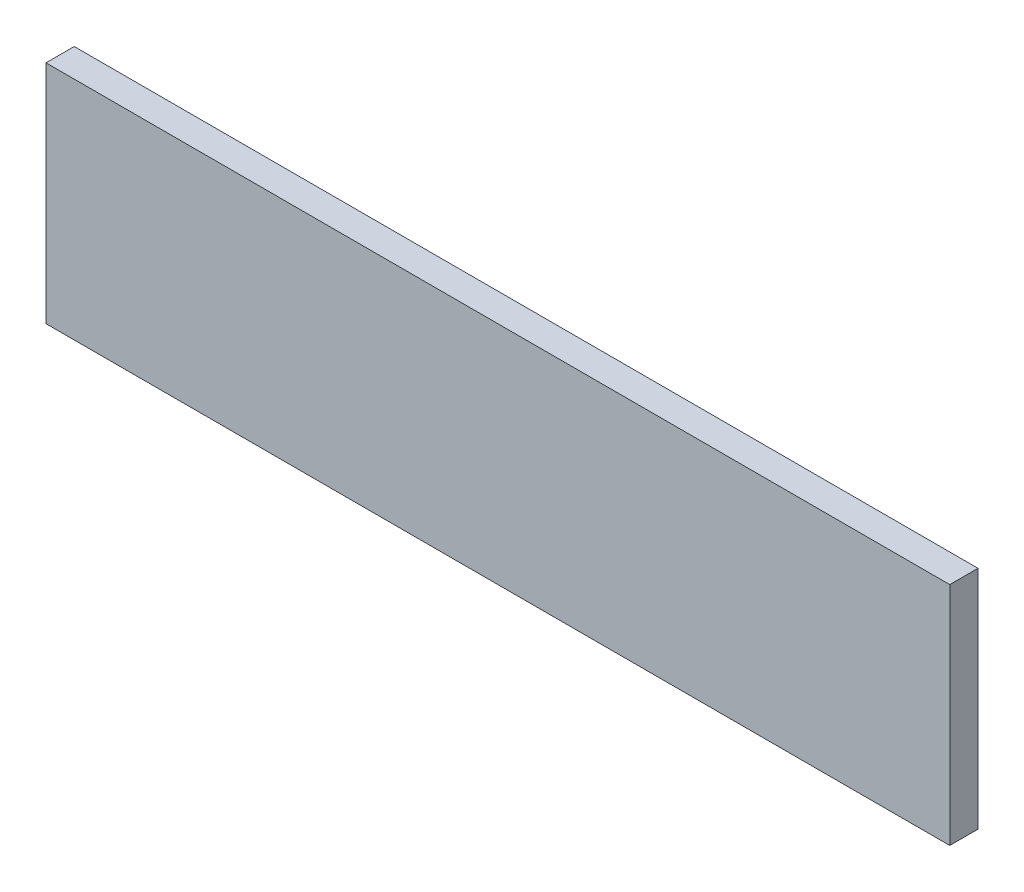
from build123d import *

# Parameters (mm, degrees)
SKETCH1_W           = 50.8
SKETCH1_H           = 12.7
BOSS_EXTRUDE1_DEPTH = 1.5875


with BuildPart() as part:
    # Sketch1 → Boss-Extrude1 (new body)
    with BuildSketch(Plane.XY):
        Rectangle(SKETCH1_W, SKETCH1_H)
    extrude(amount=BOSS_EXTRUDE1_DEPTH)


solid = part.part
